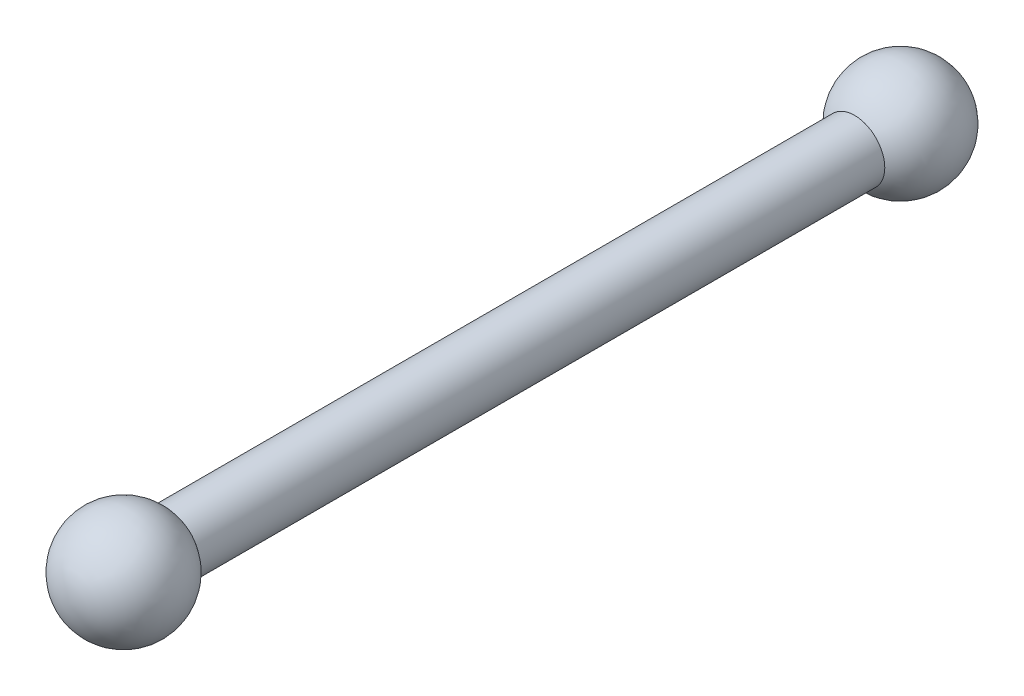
ISO-10303-21;
HEADER;
FILE_DESCRIPTION(('STEP AP214'),'2;1');
FILE_NAME('part.step','',(''),(''),'','','');
FILE_SCHEMA(('AUTOMOTIVE_DESIGN { 1 0 10303 214 1 1 1 1 }'));
ENDSEC;
DATA;
#1=APPLICATION_CONTEXT('core data for automotive mechanical design processes');
#2=APPLICATION_PROTOCOL_DEFINITION('international standard','automotive_design',2000,#1);
#3=PRODUCT_CONTEXT('',#1,'mechanical');
#4=PRODUCT('Part','Part','',(#3));
#5=PRODUCT_RELATED_PRODUCT_CATEGORY('part','',(#4));
#6=PRODUCT_DEFINITION_FORMATION('','',#4);
#7=PRODUCT_DEFINITION_CONTEXT('part definition',#1,'design');
#8=PRODUCT_DEFINITION('design','',#6,#7);
#9=PRODUCT_DEFINITION_SHAPE('','',#8);
#10=(LENGTH_UNIT() NAMED_UNIT(*) SI_UNIT(.MILLI.,.METRE.));
#11=(NAMED_UNIT(*) PLANE_ANGLE_UNIT() SI_UNIT($,.RADIAN.));
#12=(NAMED_UNIT(*) SI_UNIT($,.STERADIAN.) SOLID_ANGLE_UNIT());
#13=UNCERTAINTY_MEASURE_WITH_UNIT(LENGTH_MEASURE(1.E-05),#10,'distance_accuracy_value','');
#14=(GEOMETRIC_REPRESENTATION_CONTEXT(3) GLOBAL_UNCERTAINTY_ASSIGNED_CONTEXT((#13)) GLOBAL_UNIT_ASSIGNED_CONTEXT((#10,
#11,#12)) REPRESENTATION_CONTEXT('',''));
#15=CARTESIAN_POINT('',(0.,0.,0.));
#16=DIRECTION('',(0.,0.,1.));
#17=DIRECTION('',(1.,0.,0.));
#18=AXIS2_PLACEMENT_3D('',#15,#16,#17);
#19=CARTESIAN_POINT('',(27.5,67.,-253.727922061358));
#20=DIRECTION('',(0.,0.,1.));
#21=DIRECTION('',(1.,0.,0.));
#22=AXIS2_PLACEMENT_3D('',#19,#20,#21);
#23=CYLINDRICAL_SURFACE('',#22,4.50000000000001);
#24=CARTESIAN_POINT('',(27.5,67.,-139.));
#25=DIRECTION('',(0.,0.,-1.));
#26=DIRECTION('',(-1.,0.,0.));
#27=AXIS2_PLACEMENT_3D('',#24,#25,#26);
#28=CIRCLE('',#27,4.50000000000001);
#29=CARTESIAN_POINT('',(32.,67.,-139.));
#30=VERTEX_POINT('',#29);
#31=EDGE_CURVE('E38',#30,#30,#28,.T.);
#32=CARTESIAN_POINT('',(27.5,67.,-241.));
#33=DIRECTION('',(0.,0.,-1.));
#34=DIRECTION('',(-1.,0.,0.));
#35=AXIS2_PLACEMENT_3D('',#32,#33,#34);
#36=CIRCLE('',#35,4.50000000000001);
#37=CARTESIAN_POINT('',(32.,67.,-241.));
#38=VERTEX_POINT('',#37);
#39=EDGE_CURVE('E10',#38,#38,#36,.T.);
#40=CARTESIAN_POINT('',(32.,67.,-139.));
#41=CARTESIAN_POINT('',(32.,67.,-140.0625));
#42=CARTESIAN_POINT('',(32.,67.,-141.125));
#43=CARTESIAN_POINT('',(32.,67.,-143.25));
#44=CARTESIAN_POINT('',(32.,67.,-144.3125));
#45=CARTESIAN_POINT('',(32.,67.,-146.4375));
#46=CARTESIAN_POINT('',(32.,67.,-147.5));
#47=CARTESIAN_POINT('',(32.,67.,-149.625));
#48=CARTESIAN_POINT('',(32.,67.,-150.6875));
#49=CARTESIAN_POINT('',(32.,67.,-152.8125));
#50=CARTESIAN_POINT('',(32.,67.,-153.875));
#51=CARTESIAN_POINT('',(32.,67.,-156.));
#52=CARTESIAN_POINT('',(32.,67.,-157.0625));
#53=CARTESIAN_POINT('',(32.,67.,-159.1875));
#54=CARTESIAN_POINT('',(32.,67.,-160.25));
#55=CARTESIAN_POINT('',(32.,67.,-162.375));
#56=CARTESIAN_POINT('',(32.,67.,-163.4375));
#57=CARTESIAN_POINT('',(32.,67.,-165.5625));
#58=CARTESIAN_POINT('',(32.,67.,-166.625));
#59=CARTESIAN_POINT('',(32.,67.,-168.75));
#60=CARTESIAN_POINT('',(32.,67.,-169.8125));
#61=CARTESIAN_POINT('',(32.,67.,-171.9375));
#62=CARTESIAN_POINT('',(32.,67.,-173.));
#63=CARTESIAN_POINT('',(32.,67.,-175.125));
#64=CARTESIAN_POINT('',(32.,67.,-176.1875));
#65=CARTESIAN_POINT('',(32.,67.,-178.3125));
#66=CARTESIAN_POINT('',(32.,67.,-179.375));
#67=CARTESIAN_POINT('',(32.,67.,-181.5));
#68=CARTESIAN_POINT('',(32.,67.,-182.5625));
#69=CARTESIAN_POINT('',(32.,67.,-184.6875));
#70=CARTESIAN_POINT('',(32.,67.,-185.75));
#71=CARTESIAN_POINT('',(32.,67.,-187.875));
#72=CARTESIAN_POINT('',(32.,67.,-188.9375));
#73=CARTESIAN_POINT('',(32.,67.,-191.0625));
#74=CARTESIAN_POINT('',(32.,67.,-192.125));
#75=CARTESIAN_POINT('',(32.,67.,-194.25));
#76=CARTESIAN_POINT('',(32.,67.,-195.3125));
#77=CARTESIAN_POINT('',(32.,67.,-197.4375));
#78=CARTESIAN_POINT('',(32.,67.,-198.5));
#79=CARTESIAN_POINT('',(32.,67.,-200.625));
#80=CARTESIAN_POINT('',(32.,67.,-201.6875));
#81=CARTESIAN_POINT('',(32.,67.,-203.8125));
#82=CARTESIAN_POINT('',(32.,67.,-204.875));
#83=CARTESIAN_POINT('',(32.,67.,-207.));
#84=CARTESIAN_POINT('',(32.,67.,-208.0625));
#85=CARTESIAN_POINT('',(32.,67.,-210.1875));
#86=CARTESIAN_POINT('',(32.,67.,-211.25));
#87=CARTESIAN_POINT('',(32.,67.,-213.375));
#88=CARTESIAN_POINT('',(32.,67.,-214.4375));
#89=CARTESIAN_POINT('',(32.,67.,-216.5625));
#90=CARTESIAN_POINT('',(32.,67.,-217.625));
#91=CARTESIAN_POINT('',(32.,67.,-219.75));
#92=CARTESIAN_POINT('',(32.,67.,-220.8125));
#93=CARTESIAN_POINT('',(32.,67.,-222.9375));
#94=CARTESIAN_POINT('',(32.,67.,-224.));
#95=CARTESIAN_POINT('',(32.,67.,-226.125));
#96=CARTESIAN_POINT('',(32.,67.,-227.1875));
#97=CARTESIAN_POINT('',(32.,67.,-229.3125));
#98=CARTESIAN_POINT('',(32.,67.,-230.375));
#99=CARTESIAN_POINT('',(32.,67.,-232.5));
#100=CARTESIAN_POINT('',(32.,67.,-233.5625));
#101=CARTESIAN_POINT('',(32.,67.,-235.6875));
#102=CARTESIAN_POINT('',(32.,67.,-236.75));
#103=CARTESIAN_POINT('',(32.,67.,-238.875));
#104=CARTESIAN_POINT('',(32.,67.,-239.9375));
#105=CARTESIAN_POINT('',(32.,67.,-241.));
#106=B_SPLINE_CURVE_WITH_KNOTS('',3,(#40,#41,#42,#43,#44,#45,#46,#47,#48,#49,#50,#51,#52,#53,
#54,#55,#56,#57,#58,#59,#60,#61,#62,#63,#64,#65,#66,#67,#68,#69,#70,#71,#72,#73,#74,#75,#76,#77,
#78,#79,#80,#81,#82,#83,#84,#85,#86,#87,#88,#89,#90,#91,#92,#93,#94,#95,#96,#97,#98,#99,#100,
#101,#102,#103,#104,#105),.UNSPECIFIED.,.F.,.F.,(4,2,2,2,2,2,2,2,2,2,2,2,2,2,2,2,2,2,2,2,2,2,2,
2,2,2,2,2,2,2,2,2,4),(0.,3.18750000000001,6.37500000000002,9.56250000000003,12.75,15.9375,
19.125,22.3125,25.5,28.6875,31.875,35.0625,38.25,41.4375,44.625,47.8125,51.,54.1875,57.375,
60.5625,63.75,66.9375,70.125,73.3125,76.5,79.6875,82.875,86.0625,89.25,92.4375,95.625,98.8125,
102.),.UNSPECIFIED.);
#107=EDGE_CURVE('BSEAM34',#30,#38,#106,.T.);
#108=ORIENTED_EDGE('',*,*,#31,.T.);
#109=ORIENTED_EDGE('',*,*,#39,.F.);
#110=ORIENTED_EDGE('',*,*,#107,.T.);
#111=ORIENTED_EDGE('',*,*,#107,.F.);
#112=EDGE_LOOP('',(#108,#110,#109,#111));
#113=FACE_BOUND('',#112,.T.);
#114=ADVANCED_FACE('F34',(#113),#23,.T.);
#115=CARTESIAN_POINT('',(27.5,67.,-132.175));
#116=DIRECTION('',(0.,0.,1.));
#117=DIRECTION('',(1.,0.,0.));
#118=AXIS2_PLACEMENT_3D('',#115,#116,#117);
#119=SPHERICAL_SURFACE('',#118,8.175);
#120=ORIENTED_EDGE('',*,*,#31,.F.);
#121=EDGE_LOOP('',(#120));
#122=FACE_BOUND('',#121,.T.);
#123=ADVANCED_FACE('F36',(#122),#119,.T.);
#124=CARTESIAN_POINT('',(27.5,67.,-247.825));
#125=DIRECTION('',(0.,0.,1.));
#126=DIRECTION('',(1.,0.,0.));
#127=AXIS2_PLACEMENT_3D('',#124,#125,#126);
#128=SPHERICAL_SURFACE('',#127,8.17500000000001);
#129=ORIENTED_EDGE('',*,*,#39,.T.);
#130=EDGE_LOOP('',(#129));
#131=FACE_BOUND('',#130,.T.);
#132=ADVANCED_FACE('F50',(#131),#128,.T.);
#133=CLOSED_SHELL('',(#114,#123,#132));
#134=MANIFOLD_SOLID_BREP('B2',#133);
#135=ADVANCED_BREP_SHAPE_REPRESENTATION('',(#18,#134),#14);
#136=SHAPE_DEFINITION_REPRESENTATION(#9,#135);
ENDSEC;
END-ISO-10303-21;
